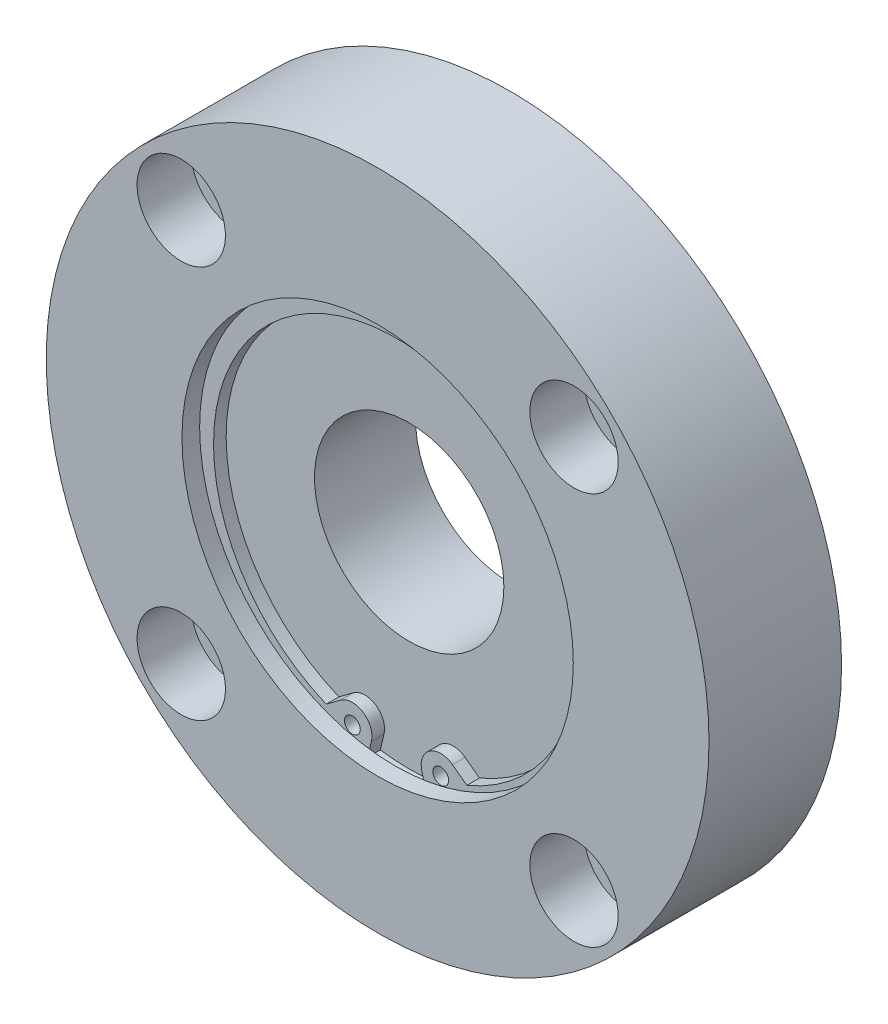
ISO-10303-21;
HEADER;
FILE_DESCRIPTION(('STEP AP214'),'2;1');
FILE_NAME('part.step','',(''),(''),'','','');
FILE_SCHEMA(('AUTOMOTIVE_DESIGN { 1 0 10303 214 1 1 1 1 }'));
ENDSEC;
DATA;
#1=APPLICATION_CONTEXT('core data for automotive mechanical design processes');
#2=APPLICATION_PROTOCOL_DEFINITION('international standard','automotive_design',2000,#1);
#3=PRODUCT_CONTEXT('',#1,'mechanical');
#4=PRODUCT('Part','Part','',(#3));
#5=PRODUCT_RELATED_PRODUCT_CATEGORY('part','',(#4));
#6=PRODUCT_DEFINITION_FORMATION('','',#4);
#7=PRODUCT_DEFINITION_CONTEXT('part definition',#1,'design');
#8=PRODUCT_DEFINITION('design','',#6,#7);
#9=PRODUCT_DEFINITION_SHAPE('','',#8);
#10=(LENGTH_UNIT() NAMED_UNIT(*) SI_UNIT(.MILLI.,.METRE.));
#11=(NAMED_UNIT(*) PLANE_ANGLE_UNIT() SI_UNIT($,.RADIAN.));
#12=(NAMED_UNIT(*) SI_UNIT($,.STERADIAN.) SOLID_ANGLE_UNIT());
#13=UNCERTAINTY_MEASURE_WITH_UNIT(LENGTH_MEASURE(1.E-05),#10,'distance_accuracy_value','');
#14=(GEOMETRIC_REPRESENTATION_CONTEXT(3) GLOBAL_UNCERTAINTY_ASSIGNED_CONTEXT((#13)) GLOBAL_UNIT_ASSIGNED_CONTEXT((#10,
#11,#12)) REPRESENTATION_CONTEXT('',''));
#15=CARTESIAN_POINT('',(0.,0.,0.));
#16=DIRECTION('',(0.,0.,1.));
#17=DIRECTION('',(1.,0.,0.));
#18=AXIS2_PLACEMENT_3D('',#15,#16,#17);
#19=CARTESIAN_POINT('',(31.112698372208,31.1126983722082,0.));
#20=DIRECTION('',(0.,0.,1.));
#21=DIRECTION('',(1.,0.,0.));
#22=AXIS2_PLACEMENT_3D('',#19,#20,#21);
#23=CYLINDRICAL_SURFACE('',#22,5.);
#24=CARTESIAN_POINT('',(31.112698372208,31.1126983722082,0.));
#25=DIRECTION('',(0.,0.,1.));
#26=DIRECTION('',(1.,0.,0.));
#27=AXIS2_PLACEMENT_3D('',#24,#25,#26);
#28=CIRCLE('',#27,5.);
#29=CARTESIAN_POINT('',(36.112698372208,31.1126983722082,0.));
#30=VERTEX_POINT('',#29);
#31=EDGE_CURVE('E237',#30,#30,#28,.T.);
#32=ORIENTED_EDGE('',*,*,#31,.F.);
#33=EDGE_LOOP('',(#32));
#34=FACE_BOUND('',#33,.T.);
#35=CARTESIAN_POINT('',(31.112698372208,31.1126983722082,12.4));
#36=DIRECTION('',(0.,0.,1.));
#37=DIRECTION('',(1.,0.,0.));
#38=AXIS2_PLACEMENT_3D('',#35,#36,#37);
#39=CIRCLE('',#38,5.);
#40=CARTESIAN_POINT('',(36.112698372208,31.1126983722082,12.4));
#41=VERTEX_POINT('',#40);
#42=EDGE_CURVE('E236',#41,#41,#39,.F.);
#43=ORIENTED_EDGE('',*,*,#42,.F.);
#44=EDGE_LOOP('',(#43));
#45=FACE_BOUND('',#44,.T.);
#46=ADVANCED_FACE('F14',(#34,#45),#23,.F.);
#47=CARTESIAN_POINT('',(31.1126983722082,-31.1126983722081,0.));
#48=DIRECTION('',(0.,0.,1.));
#49=DIRECTION('',(1.,0.,0.));
#50=AXIS2_PLACEMENT_3D('',#47,#48,#49);
#51=CYLINDRICAL_SURFACE('',#50,5.);
#52=CARTESIAN_POINT('',(31.1126983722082,-31.1126983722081,0.));
#53=DIRECTION('',(0.,0.,1.));
#54=DIRECTION('',(0.,-1.,0.));
#55=AXIS2_PLACEMENT_3D('',#52,#53,#54);
#56=CIRCLE('',#55,5.);
#57=CARTESIAN_POINT('',(31.1126983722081,-36.1126983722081,0.));
#58=VERTEX_POINT('',#57);
#59=EDGE_CURVE('E227',#58,#58,#56,.T.);
#60=ORIENTED_EDGE('',*,*,#59,.F.);
#61=EDGE_LOOP('',(#60));
#62=FACE_BOUND('',#61,.T.);
#63=CARTESIAN_POINT('',(31.1126983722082,-31.1126983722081,12.4));
#64=DIRECTION('',(0.,0.,1.));
#65=DIRECTION('',(1.,0.,0.));
#66=AXIS2_PLACEMENT_3D('',#63,#64,#65);
#67=CIRCLE('',#66,5.);
#68=CARTESIAN_POINT('',(36.1126983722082,-31.1126983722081,12.4));
#69=VERTEX_POINT('',#68);
#70=EDGE_CURVE('E220',#69,#69,#67,.F.);
#71=ORIENTED_EDGE('',*,*,#70,.F.);
#72=EDGE_LOOP('',(#71));
#73=FACE_BOUND('',#72,.T.);
#74=ADVANCED_FACE('F326',(#62,#73),#51,.F.);
#75=CARTESIAN_POINT('',(-31.1126983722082,-31.1126983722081,0.));
#76=DIRECTION('',(0.,0.,1.));
#77=DIRECTION('',(1.,0.,0.));
#78=AXIS2_PLACEMENT_3D('',#75,#76,#77);
#79=CYLINDRICAL_SURFACE('',#78,5.);
#80=CARTESIAN_POINT('',(-31.1126983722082,-31.1126983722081,0.));
#81=DIRECTION('',(0.,0.,1.));
#82=DIRECTION('',(-1.,0.,0.));
#83=AXIS2_PLACEMENT_3D('',#80,#81,#82);
#84=CIRCLE('',#83,5.);
#85=CARTESIAN_POINT('',(-36.1126983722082,-31.112698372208,0.));
#86=VERTEX_POINT('',#85);
#87=EDGE_CURVE('E224',#86,#86,#84,.T.);
#88=ORIENTED_EDGE('',*,*,#87,.F.);
#89=EDGE_LOOP('',(#88));
#90=FACE_BOUND('',#89,.T.);
#91=CARTESIAN_POINT('',(-31.1126983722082,-31.1126983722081,12.4));
#92=DIRECTION('',(0.,0.,1.));
#93=DIRECTION('',(1.,0.,0.));
#94=AXIS2_PLACEMENT_3D('',#91,#92,#93);
#95=CIRCLE('',#94,5.);
#96=CARTESIAN_POINT('',(-26.1126983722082,-31.1126983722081,12.4));
#97=VERTEX_POINT('',#96);
#98=EDGE_CURVE('E213',#97,#97,#95,.F.);
#99=ORIENTED_EDGE('',*,*,#98,.F.);
#100=EDGE_LOOP('',(#99));
#101=FACE_BOUND('',#100,.T.);
#102=ADVANCED_FACE('F332',(#90,#101),#79,.F.);
#103=CARTESIAN_POINT('',(-31.1126983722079,31.1126983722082,0.));
#104=DIRECTION('',(0.,0.,1.));
#105=DIRECTION('',(1.,0.,0.));
#106=AXIS2_PLACEMENT_3D('',#103,#104,#105);
#107=CYLINDRICAL_SURFACE('',#106,5.);
#108=CARTESIAN_POINT('',(-31.1126983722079,31.1126983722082,0.));
#109=DIRECTION('',(0.,0.,1.));
#110=DIRECTION('',(0.,1.,0.));
#111=AXIS2_PLACEMENT_3D('',#108,#109,#110);
#112=CIRCLE('',#111,5.);
#113=CARTESIAN_POINT('',(-31.1126983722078,36.1126983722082,0.));
#114=VERTEX_POINT('',#113);
#115=EDGE_CURVE('E221',#114,#114,#112,.T.);
#116=ORIENTED_EDGE('',*,*,#115,.F.);
#117=EDGE_LOOP('',(#116));
#118=FACE_BOUND('',#117,.T.);
#119=CARTESIAN_POINT('',(-31.1126983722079,31.1126983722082,12.4));
#120=DIRECTION('',(0.,0.,1.));
#121=DIRECTION('',(1.,0.,0.));
#122=AXIS2_PLACEMENT_3D('',#119,#120,#121);
#123=CIRCLE('',#122,5.);
#124=CARTESIAN_POINT('',(-26.1126983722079,31.1126983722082,12.4));
#125=VERTEX_POINT('',#124);
#126=EDGE_CURVE('E206',#125,#125,#123,.F.);
#127=ORIENTED_EDGE('',*,*,#126,.F.);
#128=EDGE_LOOP('',(#127));
#129=FACE_BOUND('',#128,.T.);
#130=ADVANCED_FACE('F624',(#118,#129),#107,.F.);
#131=CARTESIAN_POINT('',(0.,0.,-5.));
#132=DIRECTION('',(0.,0.,1.));
#133=DIRECTION('',(1.,0.,0.));
#134=AXIS2_PLACEMENT_3D('',#131,#132,#133);
#135=CYLINDRICAL_SURFACE('',#134,35.);
#136=CARTESIAN_POINT('',(0.,0.,-5.));
#137=DIRECTION('',(0.,0.,-1.));
#138=DIRECTION('',(-1.,0.,0.));
#139=AXIS2_PLACEMENT_3D('',#136,#137,#138);
#140=CIRCLE('',#139,35.);
#141=CARTESIAN_POINT('',(-35.,0.,-5.));
#142=VERTEX_POINT('',#141);
#143=EDGE_CURVE('E189',#142,#142,#140,.T.);
#144=ORIENTED_EDGE('',*,*,#143,.F.);
#145=EDGE_LOOP('',(#144));
#146=FACE_BOUND('',#145,.T.);
#147=CARTESIAN_POINT('',(0.,0.,0.));
#148=DIRECTION('',(0.,0.,-1.));
#149=DIRECTION('',(-1.,0.,0.));
#150=AXIS2_PLACEMENT_3D('',#147,#148,#149);
#151=CIRCLE('',#150,35.);
#152=CARTESIAN_POINT('',(-35.,0.,0.));
#153=VERTEX_POINT('',#152);
#154=EDGE_CURVE('E190',#153,#153,#151,.T.);
#155=ORIENTED_EDGE('',*,*,#154,.T.);
#156=EDGE_LOOP('',(#155));
#157=FACE_BOUND('',#156,.T.);
#158=ADVANCED_FACE('F616',(#146,#157),#135,.T.);
#159=CARTESIAN_POINT('',(0.,0.,0.));
#160=DIRECTION('',(0.,0.,1.));
#161=DIRECTION('',(1.,0.,0.));
#162=AXIS2_PLACEMENT_3D('',#159,#160,#161);
#163=PLANE('',#162);
#164=ORIENTED_EDGE('',*,*,#115,.T.);
#165=EDGE_LOOP('',(#164));
#166=FACE_BOUND('',#165,.T.);
#167=ORIENTED_EDGE('',*,*,#87,.T.);
#168=EDGE_LOOP('',(#167));
#169=FACE_BOUND('',#168,.T.);
#170=ORIENTED_EDGE('',*,*,#59,.T.);
#171=EDGE_LOOP('',(#170));
#172=FACE_BOUND('',#171,.T.);
#173=ORIENTED_EDGE('',*,*,#31,.T.);
#174=EDGE_LOOP('',(#173));
#175=FACE_BOUND('',#174,.T.);
#176=CARTESIAN_POINT('',(0.,0.,0.));
#177=DIRECTION('',(0.,0.,1.));
#178=DIRECTION('',(1.,0.,0.));
#179=AXIS2_PLACEMENT_3D('',#176,#177,#178);
#180=CIRCLE('',#179,52.5);
#181=CARTESIAN_POINT('',(52.5,0.,0.));
#182=VERTEX_POINT('',#181);
#183=EDGE_CURVE('E243',#182,#182,#180,.T.);
#184=ORIENTED_EDGE('',*,*,#183,.F.);
#185=EDGE_LOOP('',(#184));
#186=FACE_BOUND('',#185,.T.);
#187=ORIENTED_EDGE('',*,*,#154,.F.);
#188=EDGE_LOOP('',(#187));
#189=FACE_BOUND('',#188,.T.);
#190=ADVANCED_FACE('F351',(#166,#169,#172,#175,#186,#189),#163,.F.);
#191=CARTESIAN_POINT('',(31.112698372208,31.1126983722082,12.4));
#192=DIRECTION('',(0.,0.,1.));
#193=DIRECTION('',(1.,0.,0.));
#194=AXIS2_PLACEMENT_3D('',#191,#192,#193);
#195=PLANE('',#194);
#196=CARTESIAN_POINT('',(31.112698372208,31.1126983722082,12.4));
#197=DIRECTION('',(0.,0.,1.));
#198=DIRECTION('',(1.,0.,0.));
#199=AXIS2_PLACEMENT_3D('',#196,#197,#198);
#200=CIRCLE('',#199,7.);
#201=CARTESIAN_POINT('',(38.112698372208,31.1126983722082,12.4));
#202=VERTEX_POINT('',#201);
#203=EDGE_CURVE('E233',#202,#202,#200,.T.);
#204=ORIENTED_EDGE('',*,*,#203,.T.);
#205=EDGE_LOOP('',(#204));
#206=FACE_BOUND('',#205,.T.);
#207=ORIENTED_EDGE('',*,*,#42,.T.);
#208=EDGE_LOOP('',(#207));
#209=FACE_BOUND('',#208,.T.);
#210=ADVANCED_FACE('F598',(#206,#209),#195,.T.);
#211=CARTESIAN_POINT('',(31.1126983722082,-31.1126983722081,12.4));
#212=DIRECTION('',(0.,0.,1.));
#213=DIRECTION('',(0.,-1.,0.));
#214=AXIS2_PLACEMENT_3D('',#211,#212,#213);
#215=PLANE('',#214);
#216=CARTESIAN_POINT('',(31.1126983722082,-31.1126983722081,12.4));
#217=DIRECTION('',(0.,0.,1.));
#218=DIRECTION('',(0.,-1.,0.));
#219=AXIS2_PLACEMENT_3D('',#216,#217,#218);
#220=CIRCLE('',#219,7.);
#221=CARTESIAN_POINT('',(31.1126983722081,-38.1126983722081,12.4));
#222=VERTEX_POINT('',#221);
#223=EDGE_CURVE('E217',#222,#222,#220,.T.);
#224=ORIENTED_EDGE('',*,*,#223,.T.);
#225=EDGE_LOOP('',(#224));
#226=FACE_BOUND('',#225,.T.);
#227=ORIENTED_EDGE('',*,*,#70,.T.);
#228=EDGE_LOOP('',(#227));
#229=FACE_BOUND('',#228,.T.);
#230=ADVANCED_FACE('F589',(#226,#229),#215,.T.);
#231=CARTESIAN_POINT('',(-31.1126983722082,-31.1126983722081,12.4));
#232=DIRECTION('',(0.,0.,1.));
#233=DIRECTION('',(-1.,0.,0.));
#234=AXIS2_PLACEMENT_3D('',#231,#232,#233);
#235=PLANE('',#234);
#236=CARTESIAN_POINT('',(-31.1126983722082,-31.1126983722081,12.4));
#237=DIRECTION('',(0.,0.,1.));
#238=DIRECTION('',(-1.,0.,0.));
#239=AXIS2_PLACEMENT_3D('',#236,#237,#238);
#240=CIRCLE('',#239,7.);
#241=CARTESIAN_POINT('',(-38.1126983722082,-31.112698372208,12.4));
#242=VERTEX_POINT('',#241);
#243=EDGE_CURVE('E210',#242,#242,#240,.T.);
#244=ORIENTED_EDGE('',*,*,#243,.T.);
#245=EDGE_LOOP('',(#244));
#246=FACE_BOUND('',#245,.T.);
#247=ORIENTED_EDGE('',*,*,#98,.T.);
#248=EDGE_LOOP('',(#247));
#249=FACE_BOUND('',#248,.T.);
#250=ADVANCED_FACE('F580',(#246,#249),#235,.T.);
#251=CARTESIAN_POINT('',(-31.1126983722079,31.1126983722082,12.4));
#252=DIRECTION('',(0.,0.,1.));
#253=DIRECTION('',(0.,1.,0.));
#254=AXIS2_PLACEMENT_3D('',#251,#252,#253);
#255=PLANE('',#254);
#256=CARTESIAN_POINT('',(-31.1126983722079,31.1126983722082,12.4));
#257=DIRECTION('',(0.,0.,1.));
#258=DIRECTION('',(0.,1.,0.));
#259=AXIS2_PLACEMENT_3D('',#256,#257,#258);
#260=CIRCLE('',#259,7.);
#261=CARTESIAN_POINT('',(-31.1126983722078,38.1126983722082,12.4));
#262=VERTEX_POINT('',#261);
#263=EDGE_CURVE('E203',#262,#262,#260,.T.);
#264=ORIENTED_EDGE('',*,*,#263,.T.);
#265=EDGE_LOOP('',(#264));
#266=FACE_BOUND('',#265,.T.);
#267=ORIENTED_EDGE('',*,*,#126,.T.);
#268=EDGE_LOOP('',(#267));
#269=FACE_BOUND('',#268,.T.);
#270=ADVANCED_FACE('F571',(#266,#269),#255,.T.);
#271=CARTESIAN_POINT('',(0.,0.,-5.));
#272=DIRECTION('',(0.,0.,-1.));
#273=DIRECTION('',(-1.,0.,0.));
#274=AXIS2_PLACEMENT_3D('',#271,#272,#273);
#275=PLANE('',#274);
#276=ORIENTED_EDGE('',*,*,#143,.T.);
#277=EDGE_LOOP('',(#276));
#278=FACE_BOUND('',#277,.T.);
#279=CARTESIAN_POINT('',(0.,0.,-5.));
#280=DIRECTION('',(0.,0.,-1.));
#281=DIRECTION('',(-1.,0.,0.));
#282=AXIS2_PLACEMENT_3D('',#279,#280,#281);
#283=CIRCLE('',#282,27.5);
#284=CARTESIAN_POINT('',(-27.5,0.,-5.));
#285=VERTEX_POINT('',#284);
#286=EDGE_CURVE('E186',#285,#285,#283,.T.);
#287=ORIENTED_EDGE('',*,*,#286,.F.);
#288=EDGE_LOOP('',(#287));
#289=FACE_BOUND('',#288,.T.);
#290=ADVANCED_FACE('F358',(#278,#289),#275,.T.);
#291=CARTESIAN_POINT('',(0.,0.,21.));
#292=DIRECTION('',(0.,0.,-1.));
#293=DIRECTION('',(-1.,0.,0.));
#294=AXIS2_PLACEMENT_3D('',#291,#292,#293);
#295=CYLINDRICAL_SURFACE('',#294,52.5);
#296=CARTESIAN_POINT('',(0.,0.,21.));
#297=DIRECTION('',(0.,0.,1.));
#298=DIRECTION('',(1.,0.,0.));
#299=AXIS2_PLACEMENT_3D('',#296,#297,#298);
#300=CIRCLE('',#299,52.5);
#301=CARTESIAN_POINT('',(52.5,0.,21.));
#302=VERTEX_POINT('',#301);
#303=EDGE_CURVE('E193',#302,#302,#300,.T.);
#304=ORIENTED_EDGE('',*,*,#303,.F.);
#305=EDGE_LOOP('',(#304));
#306=FACE_BOUND('',#305,.T.);
#307=ORIENTED_EDGE('',*,*,#183,.T.);
#308=EDGE_LOOP('',(#307));
#309=FACE_BOUND('',#308,.T.);
#310=ADVANCED_FACE('F356',(#306,#309),#295,.T.);
#311=CARTESIAN_POINT('',(31.112698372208,31.1126983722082,12.4));
#312=DIRECTION('',(0.,0.,1.));
#313=DIRECTION('',(1.,0.,0.));
#314=AXIS2_PLACEMENT_3D('',#311,#312,#313);
#315=CYLINDRICAL_SURFACE('',#314,7.);
#316=ORIENTED_EDGE('',*,*,#203,.F.);
#317=EDGE_LOOP('',(#316));
#318=FACE_BOUND('',#317,.T.);
#319=CARTESIAN_POINT('',(31.112698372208,31.1126983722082,21.));
#320=DIRECTION('',(0.,0.,1.));
#321=DIRECTION('',(1.,0.,0.));
#322=AXIS2_PLACEMENT_3D('',#319,#320,#321);
#323=CIRCLE('',#322,7.);
#324=CARTESIAN_POINT('',(38.112698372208,31.1126983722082,21.));
#325=VERTEX_POINT('',#324);
#326=EDGE_CURVE('E230',#325,#325,#323,.T.);
#327=ORIENTED_EDGE('',*,*,#326,.T.);
#328=EDGE_LOOP('',(#327));
#329=FACE_BOUND('',#328,.T.);
#330=ADVANCED_FACE('F339',(#318,#329),#315,.F.);
#331=CARTESIAN_POINT('',(31.1126983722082,-31.1126983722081,12.4));
#332=DIRECTION('',(0.,0.,1.));
#333=DIRECTION('',(1.,0.,0.));
#334=AXIS2_PLACEMENT_3D('',#331,#332,#333);
#335=CYLINDRICAL_SURFACE('',#334,7.);
#336=ORIENTED_EDGE('',*,*,#223,.F.);
#337=EDGE_LOOP('',(#336));
#338=FACE_BOUND('',#337,.T.);
#339=CARTESIAN_POINT('',(31.1126983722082,-31.1126983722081,21.));
#340=DIRECTION('',(0.,0.,1.));
#341=DIRECTION('',(0.,-1.,0.));
#342=AXIS2_PLACEMENT_3D('',#339,#340,#341);
#343=CIRCLE('',#342,7.);
#344=CARTESIAN_POINT('',(31.1126983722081,-38.1126983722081,21.));
#345=VERTEX_POINT('',#344);
#346=EDGE_CURVE('E214',#345,#345,#343,.T.);
#347=ORIENTED_EDGE('',*,*,#346,.T.);
#348=EDGE_LOOP('',(#347));
#349=FACE_BOUND('',#348,.T.);
#350=ADVANCED_FACE('F538',(#338,#349),#335,.F.);
#351=CARTESIAN_POINT('',(-31.1126983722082,-31.1126983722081,12.4));
#352=DIRECTION('',(0.,0.,1.));
#353=DIRECTION('',(1.,0.,0.));
#354=AXIS2_PLACEMENT_3D('',#351,#352,#353);
#355=CYLINDRICAL_SURFACE('',#354,7.);
#356=ORIENTED_EDGE('',*,*,#243,.F.);
#357=EDGE_LOOP('',(#356));
#358=FACE_BOUND('',#357,.T.);
#359=CARTESIAN_POINT('',(-31.1126983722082,-31.1126983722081,21.));
#360=DIRECTION('',(0.,0.,1.));
#361=DIRECTION('',(-1.,0.,0.));
#362=AXIS2_PLACEMENT_3D('',#359,#360,#361);
#363=CIRCLE('',#362,7.);
#364=CARTESIAN_POINT('',(-38.1126983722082,-31.112698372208,21.));
#365=VERTEX_POINT('',#364);
#366=EDGE_CURVE('E207',#365,#365,#363,.T.);
#367=ORIENTED_EDGE('',*,*,#366,.T.);
#368=EDGE_LOOP('',(#367));
#369=FACE_BOUND('',#368,.T.);
#370=ADVANCED_FACE('F527',(#358,#369),#355,.F.);
#371=CARTESIAN_POINT('',(-31.1126983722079,31.1126983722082,12.4));
#372=DIRECTION('',(0.,0.,1.));
#373=DIRECTION('',(1.,0.,0.));
#374=AXIS2_PLACEMENT_3D('',#371,#372,#373);
#375=CYLINDRICAL_SURFACE('',#374,7.);
#376=ORIENTED_EDGE('',*,*,#263,.F.);
#377=EDGE_LOOP('',(#376));
#378=FACE_BOUND('',#377,.T.);
#379=CARTESIAN_POINT('',(-31.1126983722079,31.1126983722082,21.));
#380=DIRECTION('',(0.,0.,1.));
#381=DIRECTION('',(0.,1.,0.));
#382=AXIS2_PLACEMENT_3D('',#379,#380,#381);
#383=CIRCLE('',#382,7.);
#384=CARTESIAN_POINT('',(-31.1126983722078,38.1126983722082,21.));
#385=VERTEX_POINT('',#384);
#386=EDGE_CURVE('E200',#385,#385,#383,.T.);
#387=ORIENTED_EDGE('',*,*,#386,.T.);
#388=EDGE_LOOP('',(#387));
#389=FACE_BOUND('',#388,.T.);
#390=ADVANCED_FACE('F516',(#378,#389),#375,.F.);
#391=CARTESIAN_POINT('',(0.,0.,-5.));
#392=DIRECTION('',(0.,0.,1.));
#393=DIRECTION('',(1.,0.,0.));
#394=AXIS2_PLACEMENT_3D('',#391,#392,#393);
#395=CYLINDRICAL_SURFACE('',#394,27.5);
#396=ORIENTED_EDGE('',*,*,#286,.T.);
#397=EDGE_LOOP('',(#396));
#398=FACE_BOUND('',#397,.T.);
#399=CARTESIAN_POINT('',(0.,0.,0.));
#400=DIRECTION('',(0.,0.,-1.));
#401=DIRECTION('',(-1.,0.,0.));
#402=AXIS2_PLACEMENT_3D('',#399,#400,#401);
#403=CIRCLE('',#402,27.5);
#404=CARTESIAN_POINT('',(-27.5,0.,0.));
#405=VERTEX_POINT('',#404);
#406=EDGE_CURVE('E183',#405,#405,#403,.T.);
#407=ORIENTED_EDGE('',*,*,#406,.F.);
#408=EDGE_LOOP('',(#407));
#409=FACE_BOUND('',#408,.T.);
#410=ADVANCED_FACE('F354',(#398,#409),#395,.F.);
#411=CARTESIAN_POINT('',(0.,0.,21.));
#412=DIRECTION('',(0.,0.,1.));
#413=DIRECTION('',(1.,0.,0.));
#414=AXIS2_PLACEMENT_3D('',#411,#412,#413);
#415=PLANE('',#414);
#416=CARTESIAN_POINT('',(0.,0.,21.));
#417=DIRECTION('',(0.,0.,1.));
#418=DIRECTION('',(1.,0.,0.));
#419=AXIS2_PLACEMENT_3D('',#416,#417,#418);
#420=CIRCLE('',#419,31.);
#421=CARTESIAN_POINT('',(31.,0.,21.));
#422=VERTEX_POINT('',#421);
#423=EDGE_CURVE('E196',#422,#422,#420,.T.);
#424=ORIENTED_EDGE('',*,*,#423,.F.);
#425=EDGE_LOOP('',(#424));
#426=FACE_BOUND('',#425,.T.);
#427=ORIENTED_EDGE('',*,*,#386,.F.);
#428=EDGE_LOOP('',(#427));
#429=FACE_BOUND('',#428,.T.);
#430=ORIENTED_EDGE('',*,*,#366,.F.);
#431=EDGE_LOOP('',(#430));
#432=FACE_BOUND('',#431,.T.);
#433=ORIENTED_EDGE('',*,*,#346,.F.);
#434=EDGE_LOOP('',(#433));
#435=FACE_BOUND('',#434,.T.);
#436=ORIENTED_EDGE('',*,*,#326,.F.);
#437=EDGE_LOOP('',(#436));
#438=FACE_BOUND('',#437,.T.);
#439=ORIENTED_EDGE('',*,*,#303,.T.);
#440=EDGE_LOOP('',(#439));
#441=FACE_BOUND('',#440,.T.);
#442=ADVANCED_FACE('F349',(#426,#429,#432,#435,#438,#441),#415,.T.);
#443=ORIENTED_EDGE('',*,*,#406,.T.);
#444=EDGE_LOOP('',(#443));
#445=FACE_BOUND('',#444,.T.);
#446=CARTESIAN_POINT('',(0.,0.,0.));
#447=DIRECTION('',(0.,0.,1.));
#448=DIRECTION('',(1.,0.,0.));
#449=AXIS2_PLACEMENT_3D('',#446,#447,#448);
#450=CIRCLE('',#449,15.);
#451=CARTESIAN_POINT('',(15.,0.,0.));
#452=VERTEX_POINT('',#451);
#453=EDGE_CURVE('E240',#452,#452,#450,.T.);
#454=ORIENTED_EDGE('',*,*,#453,.T.);
#455=EDGE_LOOP('',(#454));
#456=FACE_BOUND('',#455,.T.);
#457=ADVANCED_FACE('F346',(#445,#456),#163,.F.);
#458=CARTESIAN_POINT('',(0.,0.,16.));
#459=DIRECTION('',(0.,0.,1.));
#460=DIRECTION('',(1.,0.,0.));
#461=AXIS2_PLACEMENT_3D('',#458,#459,#460);
#462=CYLINDRICAL_SURFACE('',#461,31.);
#463=CARTESIAN_POINT('',(0.,0.,18.2));
#464=DIRECTION('',(0.,0.,1.));
#465=DIRECTION('',(1.,0.,0.));
#466=AXIS2_PLACEMENT_3D('',#463,#464,#465);
#467=CIRCLE('',#466,31.);
#468=CARTESIAN_POINT('',(31.,0.,18.2));
#469=VERTEX_POINT('',#468);
#470=EDGE_CURVE('E180',#469,#469,#467,.F.);
#471=ORIENTED_EDGE('',*,*,#470,.T.);
#472=EDGE_LOOP('',(#471));
#473=FACE_BOUND('',#472,.T.);
#474=ORIENTED_EDGE('',*,*,#423,.T.);
#475=EDGE_LOOP('',(#474));
#476=FACE_BOUND('',#475,.T.);
#477=ADVANCED_FACE('F344',(#473,#476),#462,.F.);
#478=CARTESIAN_POINT('',(0.,0.,21.));
#479=DIRECTION('',(0.,0.,-1.));
#480=DIRECTION('',(-1.,0.,0.));
#481=AXIS2_PLACEMENT_3D('',#478,#479,#480);
#482=CYLINDRICAL_SURFACE('',#481,15.);
#483=ORIENTED_EDGE('',*,*,#453,.F.);
#484=EDGE_LOOP('',(#483));
#485=FACE_BOUND('',#484,.T.);
#486=CARTESIAN_POINT('',(0.,0.,16.));
#487=DIRECTION('',(0.,0.,1.));
#488=DIRECTION('',(1.,0.,0.));
#489=AXIS2_PLACEMENT_3D('',#486,#487,#488);
#490=CIRCLE('',#489,15.);
#491=CARTESIAN_POINT('',(15.,0.,16.));
#492=VERTEX_POINT('',#491);
#493=EDGE_CURVE('E199',#492,#492,#490,.T.);
#494=ORIENTED_EDGE('',*,*,#493,.T.);
#495=EDGE_LOOP('',(#494));
#496=FACE_BOUND('',#495,.T.);
#497=ADVANCED_FACE('F341',(#485,#496),#482,.F.);
#498=CARTESIAN_POINT('',(0.,0.,16.));
#499=DIRECTION('',(0.,0.,1.));
#500=DIRECTION('',(1.,0.,0.));
#501=AXIS2_PLACEMENT_3D('',#498,#499,#500);
#502=PLANE('',#501);
#503=ORIENTED_EDGE('',*,*,#493,.F.);
#504=EDGE_LOOP('',(#503));
#505=FACE_BOUND('',#504,.T.);
#506=CARTESIAN_POINT('',(0.,0.,16.));
#507=DIRECTION('',(0.,0.,1.));
#508=DIRECTION('',(1.,0.,0.));
#509=AXIS2_PLACEMENT_3D('',#506,#507,#508);
#510=CIRCLE('',#509,32.5);
#511=CARTESIAN_POINT('',(-4.57780651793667,-32.1759799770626,16.));
#512=VERTEX_POINT('',#511);
#513=CARTESIAN_POINT('',(4.57780651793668,-32.1759799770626,16.));
#514=VERTEX_POINT('',#513);
#515=EDGE_CURVE('E171',#512,#514,#510,.T.);
#516=ORIENTED_EDGE('',*,*,#515,.T.);
#517=DIRECTION('',(-0.231349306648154,0.972870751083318,0.));
#518=VECTOR('',#517,1.);
#519=CARTESIAN_POINT('',(-2.90915263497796,-0.691798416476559,16.));
#520=LINE('',#519,#518);
#521=CARTESIAN_POINT('',(3.98410067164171,-29.6793264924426,16.));
#522=VERTEX_POINT('',#521);
#523=EDGE_CURVE('E9',#514,#522,#520,.T.);
#524=ORIENTED_EDGE('',*,*,#523,.T.);
#525=CARTESIAN_POINT('',(7.,-28.9621436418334,16.));
#526=DIRECTION('',(0.,0.,1.));
#527=DIRECTION('',(1.,0.,0.));
#528=AXIS2_PLACEMENT_3D('',#525,#526,#527);
#529=CIRCLE('',#528,3.1);
#530=CARTESIAN_POINT('',(8.84931667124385,-26.4741669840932,16.));
#531=VERTEX_POINT('',#530);
#532=EDGE_CURVE('E25',#531,#522,#529,.T.);
#533=ORIENTED_EDGE('',*,*,#532,.F.);
#534=DIRECTION('',(0.802573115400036,-0.596553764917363,0.));
#535=VECTOR('',#534,1.);
#536=CARTESIAN_POINT('',(-9.52598617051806,-12.8157776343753,16.));
#537=LINE('',#536,#535);
#538=CARTESIAN_POINT('',(11.1384133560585,-28.1756558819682,16.));
#539=VERTEX_POINT('',#538);
#540=EDGE_CURVE('E102',#531,#539,#537,.T.);
#541=ORIENTED_EDGE('',*,*,#540,.T.);
#542=CARTESIAN_POINT('',(0.,-1.4,16.));
#543=DIRECTION('',(0.,0.,1.));
#544=DIRECTION('',(1.,0.,0.));
#545=AXIS2_PLACEMENT_3D('',#542,#543,#544);
#546=CIRCLE('',#545,29.);
#547=CARTESIAN_POINT('',(-11.1384133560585,-28.1756558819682,16.));
#548=VERTEX_POINT('',#547);
#549=EDGE_CURVE('E106',#539,#548,#546,.T.);
#550=ORIENTED_EDGE('',*,*,#549,.T.);
#551=DIRECTION('',(0.802573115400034,0.596553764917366,0.));
#552=VECTOR('',#551,1.);
#553=CARTESIAN_POINT('',(9.52598617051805,-12.8157776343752,16.));
#554=LINE('',#553,#552);
#555=CARTESIAN_POINT('',(-8.84931667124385,-26.4741669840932,16.));
#556=VERTEX_POINT('',#555);
#557=EDGE_CURVE('E120',#548,#556,#554,.T.);
#558=ORIENTED_EDGE('',*,*,#557,.T.);
#559=CARTESIAN_POINT('',(-7.,-28.9621436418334,16.));
#560=DIRECTION('',(0.,0.,1.));
#561=DIRECTION('',(1.,0.,0.));
#562=AXIS2_PLACEMENT_3D('',#559,#560,#561);
#563=CIRCLE('',#562,3.1);
#564=CARTESIAN_POINT('',(-3.98410067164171,-29.6793264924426,16.));
#565=VERTEX_POINT('',#564);
#566=EDGE_CURVE('E274',#565,#556,#563,.T.);
#567=ORIENTED_EDGE('',*,*,#566,.F.);
#568=DIRECTION('',(-0.231349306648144,-0.97287075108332,0.));
#569=VECTOR('',#568,1.);
#570=CARTESIAN_POINT('',(2.90915263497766,-0.691798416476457,16.));
#571=LINE('',#570,#569);
#572=EDGE_CURVE('E277',#565,#512,#571,.T.);
#573=ORIENTED_EDGE('',*,*,#572,.T.);
#574=EDGE_LOOP('',(#516,#524,#533,#541,#550,#558,#567,#573));
#575=FACE_BOUND('',#574,.T.);
#576=ADVANCED_FACE('F105',(#505,#575),#502,.T.);
#577=CARTESIAN_POINT('',(0.,0.,18.2));
#578=DIRECTION('',(0.,0.,1.));
#579=DIRECTION('',(1.,0.,0.));
#580=AXIS2_PLACEMENT_3D('',#577,#578,#579);
#581=PLANE('',#580);
#582=CARTESIAN_POINT('',(0.,0.,18.2));
#583=DIRECTION('',(0.,0.,1.));
#584=DIRECTION('',(1.,0.,0.));
#585=AXIS2_PLACEMENT_3D('',#582,#583,#584);
#586=CIRCLE('',#585,32.5);
#587=CARTESIAN_POINT('',(32.5,0.,18.2));
#588=VERTEX_POINT('',#587);
#589=EDGE_CURVE('E176',#588,#588,#586,.T.);
#590=ORIENTED_EDGE('',*,*,#589,.F.);
#591=EDGE_LOOP('',(#590));
#592=FACE_BOUND('',#591,.T.);
#593=ORIENTED_EDGE('',*,*,#470,.F.);
#594=EDGE_LOOP('',(#593));
#595=FACE_BOUND('',#594,.T.);
#596=ADVANCED_FACE('F457',(#592,#595),#581,.F.);
#597=CARTESIAN_POINT('',(0.,0.,18.2));
#598=DIRECTION('',(0.,0.,-1.));
#599=DIRECTION('',(-1.,0.,0.));
#600=AXIS2_PLACEMENT_3D('',#597,#598,#599);
#601=CYLINDRICAL_SURFACE('',#600,32.5);
#602=ORIENTED_EDGE('',*,*,#589,.T.);
#603=EDGE_LOOP('',(#602));
#604=FACE_BOUND('',#603,.T.);
#605=CARTESIAN_POINT('',(0.,0.,18.));
#606=DIRECTION('',(0.,0.,-1.));
#607=DIRECTION('',(-1.,0.,0.));
#608=AXIS2_PLACEMENT_3D('',#605,#606,#607);
#609=CIRCLE('',#608,32.5);
#610=CARTESIAN_POINT('',(-4.57780651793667,-32.1759799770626,18.));
#611=VERTEX_POINT('',#610);
#612=CARTESIAN_POINT('',(4.57780651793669,-32.1759799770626,18.));
#613=VERTEX_POINT('',#612);
#614=EDGE_CURVE('E261',#611,#613,#609,.T.);
#615=ORIENTED_EDGE('',*,*,#614,.T.);
#616=DIRECTION('',(0.,0.,-1.));
#617=VECTOR('',#616,1.);
#618=CARTESIAN_POINT('',(4.57780651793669,-32.1759799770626,18.2));
#619=LINE('',#618,#617);
#620=EDGE_CURVE('E264',#613,#514,#619,.T.);
#621=ORIENTED_EDGE('',*,*,#620,.T.);
#622=ORIENTED_EDGE('',*,*,#515,.F.);
#623=DIRECTION('',(0.,0.,-1.));
#624=VECTOR('',#623,1.);
#625=CARTESIAN_POINT('',(-4.57780651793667,-32.1759799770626,18.2));
#626=LINE('',#625,#624);
#627=EDGE_CURVE('E74',#512,#611,#626,.F.);
#628=ORIENTED_EDGE('',*,*,#627,.T.);
#629=EDGE_LOOP('',(#615,#621,#622,#628));
#630=FACE_BOUND('',#629,.T.);
#631=ADVANCED_FACE('F296',(#604,#630),#601,.F.);
#632=CARTESIAN_POINT('',(7.,-28.9621436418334,16.));
#633=DIRECTION('',(0.,0.,1.));
#634=DIRECTION('',(1.,0.,0.));
#635=AXIS2_PLACEMENT_3D('',#632,#633,#634);
#636=CIRCLE('',#635,1.25);
#637=CARTESIAN_POINT('',(8.25,-28.9621436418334,16.));
#638=VERTEX_POINT('',#637);
#639=EDGE_CURVE('E266',#638,#638,#636,.T.);
#640=ORIENTED_EDGE('',*,*,#639,.T.);
#641=EDGE_LOOP('',(#640));
#642=FACE_BOUND('',#641,.T.);
#643=ADVANCED_FACE('F320',(#642),#502,.T.);
#644=CARTESIAN_POINT('',(-7.,-28.9621436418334,16.));
#645=DIRECTION('',(0.,0.,1.));
#646=DIRECTION('',(1.,0.,0.));
#647=AXIS2_PLACEMENT_3D('',#644,#645,#646);
#648=CIRCLE('',#647,1.25);
#649=CARTESIAN_POINT('',(-5.75,-28.9621436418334,16.));
#650=VERTEX_POINT('',#649);
#651=EDGE_CURVE('E270',#650,#650,#648,.T.);
#652=ORIENTED_EDGE('',*,*,#651,.T.);
#653=EDGE_LOOP('',(#652));
#654=FACE_BOUND('',#653,.T.);
#655=ADVANCED_FACE('F431',(#654),#502,.T.);
#656=CARTESIAN_POINT('',(8.84931667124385,-26.4741669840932,18.));
#657=DIRECTION('',(-0.596553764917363,-0.802573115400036,0.));
#658=DIRECTION('',(-0.802573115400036,0.596553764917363,0.));
#659=AXIS2_PLACEMENT_3D('',#656,#657,#658);
#660=PLANE('',#659);
#661=ORIENTED_EDGE('',*,*,#540,.F.);
#662=DIRECTION('',(0.,0.,-1.));
#663=VECTOR('',#662,1.);
#664=CARTESIAN_POINT('',(8.84931667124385,-26.4741669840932,18.));
#665=LINE('',#664,#663);
#666=CARTESIAN_POINT('',(8.84931667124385,-26.4741669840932,18.));
#667=VERTEX_POINT('',#666);
#668=EDGE_CURVE('E135',#667,#531,#665,.T.);
#669=ORIENTED_EDGE('',*,*,#668,.F.);
#670=DIRECTION('',(-0.802573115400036,0.596553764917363,0.));
#671=VECTOR('',#670,1.);
#672=CARTESIAN_POINT('',(8.84931667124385,-26.4741669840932,18.));
#673=LINE('',#672,#671);
#674=CARTESIAN_POINT('',(11.1384133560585,-28.1756558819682,18.));
#675=VERTEX_POINT('',#674);
#676=EDGE_CURVE('E123',#675,#667,#673,.T.);
#677=ORIENTED_EDGE('',*,*,#676,.F.);
#678=DIRECTION('',(0.,0.,-1.));
#679=VECTOR('',#678,1.);
#680=CARTESIAN_POINT('',(11.1384133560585,-28.1756558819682,18.));
#681=LINE('',#680,#679);
#682=EDGE_CURVE('E116',#675,#539,#681,.T.);
#683=ORIENTED_EDGE('',*,*,#682,.T.);
#684=EDGE_LOOP('',(#661,#669,#677,#683));
#685=FACE_BOUND('',#684,.T.);
#686=ADVANCED_FACE('F16',(#685),#660,.F.);
#687=CARTESIAN_POINT('',(0.,-1.4,18.));
#688=DIRECTION('',(0.,0.,1.));
#689=DIRECTION('',(-1.,0.,0.));
#690=AXIS2_PLACEMENT_3D('',#687,#688,#689);
#691=CYLINDRICAL_SURFACE('',#690,29.);
#692=ORIENTED_EDGE('',*,*,#549,.F.);
#693=ORIENTED_EDGE('',*,*,#682,.F.);
#694=CARTESIAN_POINT('',(0.,-1.4,18.));
#695=DIRECTION('',(0.,0.,-1.));
#696=DIRECTION('',(0.,-1.,0.));
#697=AXIS2_PLACEMENT_3D('',#694,#695,#696);
#698=CIRCLE('',#697,29.);
#699=CARTESIAN_POINT('',(-11.1384133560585,-28.1756558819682,18.));
#700=VERTEX_POINT('',#699);
#701=EDGE_CURVE('E130',#700,#675,#698,.T.);
#702=ORIENTED_EDGE('',*,*,#701,.F.);
#703=DIRECTION('',(0.,0.,-1.));
#704=VECTOR('',#703,1.);
#705=CARTESIAN_POINT('',(-11.1384133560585,-28.1756558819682,18.));
#706=LINE('',#705,#704);
#707=EDGE_CURVE('E118',#700,#548,#706,.T.);
#708=ORIENTED_EDGE('',*,*,#707,.T.);
#709=EDGE_LOOP('',(#692,#693,#702,#708));
#710=FACE_BOUND('',#709,.T.);
#711=ADVANCED_FACE('F114',(#710),#691,.F.);
#712=CARTESIAN_POINT('',(-8.84931667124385,-26.4741669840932,18.));
#713=DIRECTION('',(0.596553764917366,-0.802573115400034,0.));
#714=DIRECTION('',(0.,0.,-1.));
#715=AXIS2_PLACEMENT_3D('',#712,#713,#714);
#716=PLANE('',#715);
#717=ORIENTED_EDGE('',*,*,#557,.F.);
#718=ORIENTED_EDGE('',*,*,#707,.F.);
#719=DIRECTION('',(-0.802573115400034,-0.596553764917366,0.));
#720=VECTOR('',#719,1.);
#721=CARTESIAN_POINT('',(-8.84931667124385,-26.4741669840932,18.));
#722=LINE('',#721,#720);
#723=CARTESIAN_POINT('',(-8.84931667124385,-26.4741669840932,18.));
#724=VERTEX_POINT('',#723);
#725=EDGE_CURVE('E18',#724,#700,#722,.T.);
#726=ORIENTED_EDGE('',*,*,#725,.F.);
#727=DIRECTION('',(0.,0.,-1.));
#728=VECTOR('',#727,1.);
#729=CARTESIAN_POINT('',(-8.84931667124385,-26.4741669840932,18.));
#730=LINE('',#729,#728);
#731=EDGE_CURVE('E129',#724,#556,#730,.T.);
#732=ORIENTED_EDGE('',*,*,#731,.T.);
#733=EDGE_LOOP('',(#717,#718,#726,#732));
#734=FACE_BOUND('',#733,.T.);
#735=ADVANCED_FACE('F310',(#734),#716,.F.);
#736=CARTESIAN_POINT('',(-7.,-28.9621436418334,18.));
#737=DIRECTION('',(0.,0.,1.));
#738=DIRECTION('',(-1.,0.,0.));
#739=AXIS2_PLACEMENT_3D('',#736,#737,#738);
#740=CYLINDRICAL_SURFACE('',#739,1.25);
#741=ORIENTED_EDGE('',*,*,#651,.F.);
#742=EDGE_LOOP('',(#741));
#743=FACE_BOUND('',#742,.T.);
#744=CARTESIAN_POINT('',(-7.,-28.9621436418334,18.));
#745=DIRECTION('',(0.,0.,-1.));
#746=DIRECTION('',(1.,0.,0.));
#747=AXIS2_PLACEMENT_3D('',#744,#745,#746);
#748=CIRCLE('',#747,1.25);
#749=CARTESIAN_POINT('',(-5.75,-28.9621436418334,18.));
#750=VERTEX_POINT('',#749);
#751=EDGE_CURVE('E133',#750,#750,#748,.T.);
#752=ORIENTED_EDGE('',*,*,#751,.F.);
#753=EDGE_LOOP('',(#752));
#754=FACE_BOUND('',#753,.T.);
#755=ADVANCED_FACE('F307',(#743,#754),#740,.F.);
#756=CARTESIAN_POINT('',(7.,-28.9621436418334,18.));
#757=DIRECTION('',(0.,0.,1.));
#758=DIRECTION('',(-1.,0.,0.));
#759=AXIS2_PLACEMENT_3D('',#756,#757,#758);
#760=CYLINDRICAL_SURFACE('',#759,1.25);
#761=ORIENTED_EDGE('',*,*,#639,.F.);
#762=EDGE_LOOP('',(#761));
#763=FACE_BOUND('',#762,.T.);
#764=CARTESIAN_POINT('',(7.,-28.9621436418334,18.));
#765=DIRECTION('',(0.,0.,1.));
#766=DIRECTION('',(1.,0.,0.));
#767=AXIS2_PLACEMENT_3D('',#764,#765,#766);
#768=CIRCLE('',#767,1.25);
#769=CARTESIAN_POINT('',(8.25,-28.9621436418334,18.));
#770=VERTEX_POINT('',#769);
#771=EDGE_CURVE('E156',#770,#770,#768,.T.);
#772=ORIENTED_EDGE('',*,*,#771,.T.);
#773=EDGE_LOOP('',(#772));
#774=FACE_BOUND('',#773,.T.);
#775=ADVANCED_FACE('F309',(#763,#774),#760,.F.);
#776=CARTESIAN_POINT('',(7.,-28.9621436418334,18.));
#777=DIRECTION('',(0.,0.,1.));
#778=DIRECTION('',(-1.,0.,0.));
#779=AXIS2_PLACEMENT_3D('',#776,#777,#778);
#780=CYLINDRICAL_SURFACE('',#779,3.1);
#781=ORIENTED_EDGE('',*,*,#532,.T.);
#782=DIRECTION('',(0.,0.,-1.));
#783=VECTOR('',#782,1.);
#784=CARTESIAN_POINT('',(3.98410067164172,-29.6793264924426,18.));
#785=LINE('',#784,#783);
#786=CARTESIAN_POINT('',(3.98410067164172,-29.6793264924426,18.));
#787=VERTEX_POINT('',#786);
#788=EDGE_CURVE('E138',#787,#522,#785,.T.);
#789=ORIENTED_EDGE('',*,*,#788,.F.);
#790=CARTESIAN_POINT('',(7.,-28.9621436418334,18.));
#791=DIRECTION('',(0.,0.,1.));
#792=DIRECTION('',(1.,0.,0.));
#793=AXIS2_PLACEMENT_3D('',#790,#791,#792);
#794=CIRCLE('',#793,3.1);
#795=EDGE_CURVE('E147',#667,#787,#794,.T.);
#796=ORIENTED_EDGE('',*,*,#795,.F.);
#797=ORIENTED_EDGE('',*,*,#668,.T.);
#798=EDGE_LOOP('',(#781,#789,#796,#797));
#799=FACE_BOUND('',#798,.T.);
#800=ADVANCED_FACE('F291',(#799),#780,.T.);
#801=CARTESIAN_POINT('',(0.,-1.4,18.));
#802=DIRECTION('',(0.,0.,-1.));
#803=DIRECTION('',(0.,-1.,0.));
#804=AXIS2_PLACEMENT_3D('',#801,#802,#803);
#805=PLANE('',#804);
#806=ORIENTED_EDGE('',*,*,#771,.F.);
#807=EDGE_LOOP('',(#806));
#808=FACE_BOUND('',#807,.T.);
#809=ORIENTED_EDGE('',*,*,#751,.T.);
#810=EDGE_LOOP('',(#809));
#811=FACE_BOUND('',#810,.T.);
#812=ORIENTED_EDGE('',*,*,#614,.F.);
#813=DIRECTION('',(0.231349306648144,0.97287075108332,0.));
#814=VECTOR('',#813,1.);
#815=CARTESIAN_POINT('',(-3.98410067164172,-29.6793264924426,18.));
#816=LINE('',#815,#814);
#817=CARTESIAN_POINT('',(-3.98410067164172,-29.6793264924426,18.));
#818=VERTEX_POINT('',#817);
#819=EDGE_CURVE('E148',#611,#818,#816,.T.);
#820=ORIENTED_EDGE('',*,*,#819,.T.);
#821=CARTESIAN_POINT('',(-7.,-28.9621436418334,18.));
#822=DIRECTION('',(0.,0.,1.));
#823=DIRECTION('',(-1.,0.,0.));
#824=AXIS2_PLACEMENT_3D('',#821,#822,#823);
#825=CIRCLE('',#824,3.1);
#826=EDGE_CURVE('E151',#818,#724,#825,.T.);
#827=ORIENTED_EDGE('',*,*,#826,.T.);
#828=ORIENTED_EDGE('',*,*,#725,.T.);
#829=ORIENTED_EDGE('',*,*,#701,.T.);
#830=ORIENTED_EDGE('',*,*,#676,.T.);
#831=ORIENTED_EDGE('',*,*,#795,.T.);
#832=DIRECTION('',(0.231349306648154,-0.972870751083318,0.));
#833=VECTOR('',#832,1.);
#834=CARTESIAN_POINT('',(3.98410067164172,-29.6793264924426,18.));
#835=LINE('',#834,#833);
#836=EDGE_CURVE('E143',#787,#613,#835,.T.);
#837=ORIENTED_EDGE('',*,*,#836,.T.);
#838=EDGE_LOOP('',(#812,#820,#827,#828,#829,#830,#831,#837));
#839=FACE_BOUND('',#838,.T.);
#840=ADVANCED_FACE('F288',(#808,#811,#839),#805,.F.);
#841=CARTESIAN_POINT('',(-7.,-28.9621436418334,18.));
#842=DIRECTION('',(0.,0.,1.));
#843=DIRECTION('',(-1.,0.,0.));
#844=AXIS2_PLACEMENT_3D('',#841,#842,#843);
#845=CYLINDRICAL_SURFACE('',#844,3.1);
#846=ORIENTED_EDGE('',*,*,#566,.T.);
#847=ORIENTED_EDGE('',*,*,#731,.F.);
#848=ORIENTED_EDGE('',*,*,#826,.F.);
#849=DIRECTION('',(0.,0.,-1.));
#850=VECTOR('',#849,1.);
#851=CARTESIAN_POINT('',(-3.98410067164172,-29.6793264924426,18.));
#852=LINE('',#851,#850);
#853=EDGE_CURVE('E142',#818,#565,#852,.T.);
#854=ORIENTED_EDGE('',*,*,#853,.T.);
#855=EDGE_LOOP('',(#846,#847,#848,#854));
#856=FACE_BOUND('',#855,.T.);
#857=ADVANCED_FACE('F298',(#856),#845,.T.);
#858=CARTESIAN_POINT('',(-3.98410067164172,-29.6793264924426,18.));
#859=DIRECTION('',(-0.97287075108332,0.231349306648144,0.));
#860=DIRECTION('',(0.,0.,1.));
#861=AXIS2_PLACEMENT_3D('',#858,#859,#860);
#862=PLANE('',#861);
#863=ORIENTED_EDGE('',*,*,#627,.F.);
#864=ORIENTED_EDGE('',*,*,#572,.F.);
#865=ORIENTED_EDGE('',*,*,#853,.F.);
#866=ORIENTED_EDGE('',*,*,#819,.F.);
#867=EDGE_LOOP('',(#863,#864,#865,#866));
#868=FACE_BOUND('',#867,.T.);
#869=ADVANCED_FACE('F297',(#868),#862,.F.);
#870=CARTESIAN_POINT('',(3.98410067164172,-29.6793264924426,18.));
#871=DIRECTION('',(0.972870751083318,0.231349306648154,0.));
#872=DIRECTION('',(0.,0.,-1.));
#873=AXIS2_PLACEMENT_3D('',#870,#871,#872);
#874=PLANE('',#873);
#875=ORIENTED_EDGE('',*,*,#620,.F.);
#876=ORIENTED_EDGE('',*,*,#836,.F.);
#877=ORIENTED_EDGE('',*,*,#788,.T.);
#878=ORIENTED_EDGE('',*,*,#523,.F.);
#879=EDGE_LOOP('',(#875,#876,#877,#878));
#880=FACE_BOUND('',#879,.T.);
#881=ADVANCED_FACE('F294',(#880),#874,.F.);
#882=CLOSED_SHELL('',(#46,#74,#102,#130,#158,#190,#210,#230,#250,#270,#290,#310,#330,#350,#370,
#390,#410,#442,#457,#477,#497,#576,#596,#631,#643,#655,#686,#711,#735,#755,#775,#800,#840,#857,
#869,#881));
#883=MANIFOLD_SOLID_BREP('B1',#882);
#884=ADVANCED_BREP_SHAPE_REPRESENTATION('',(#18,#883),#14);
#885=SHAPE_DEFINITION_REPRESENTATION(#9,#884);
ENDSEC;
END-ISO-10303-21;
